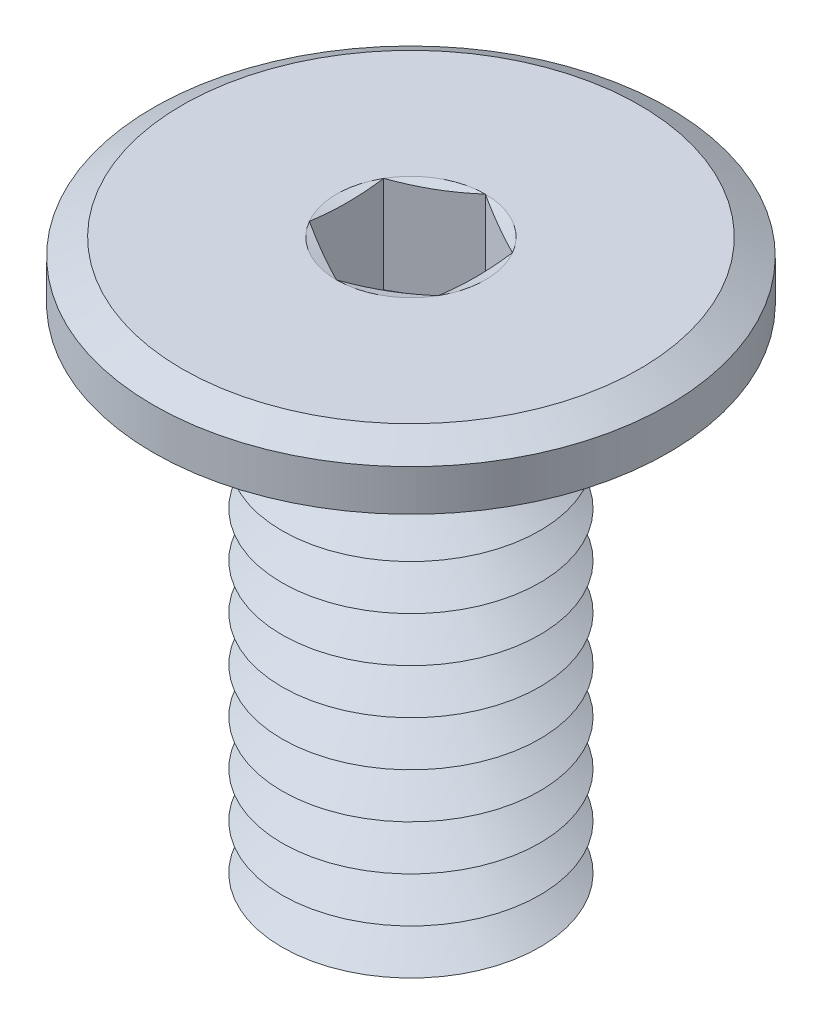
ISO-10303-21;
HEADER;
FILE_DESCRIPTION(('STEP AP214'),'2;1');
FILE_NAME('part.step','',(''),(''),'','','');
FILE_SCHEMA(('AUTOMOTIVE_DESIGN { 1 0 10303 214 1 1 1 1 }'));
ENDSEC;
DATA;
#1=APPLICATION_CONTEXT('core data for automotive mechanical design processes');
#2=APPLICATION_PROTOCOL_DEFINITION('international standard','automotive_design',2000,#1);
#3=PRODUCT_CONTEXT('',#1,'mechanical');
#4=PRODUCT('Part','Part','',(#3));
#5=PRODUCT_RELATED_PRODUCT_CATEGORY('part','',(#4));
#6=PRODUCT_DEFINITION_FORMATION('','',#4);
#7=PRODUCT_DEFINITION_CONTEXT('part definition',#1,'design');
#8=PRODUCT_DEFINITION('design','',#6,#7);
#9=PRODUCT_DEFINITION_SHAPE('','',#8);
#10=(LENGTH_UNIT() NAMED_UNIT(*) SI_UNIT(.MILLI.,.METRE.));
#11=(NAMED_UNIT(*) PLANE_ANGLE_UNIT() SI_UNIT($,.RADIAN.));
#12=(NAMED_UNIT(*) SI_UNIT($,.STERADIAN.) SOLID_ANGLE_UNIT());
#13=UNCERTAINTY_MEASURE_WITH_UNIT(LENGTH_MEASURE(1.E-05),#10,'distance_accuracy_value','');
#14=(GEOMETRIC_REPRESENTATION_CONTEXT(3) GLOBAL_UNCERTAINTY_ASSIGNED_CONTEXT((#13)) GLOBAL_UNIT_ASSIGNED_CONTEXT((#10,
#11,#12)) REPRESENTATION_CONTEXT('',''));
#15=CARTESIAN_POINT('',(0.,0.,0.));
#16=DIRECTION('',(0.,0.,1.));
#17=DIRECTION('',(1.,0.,0.));
#18=AXIS2_PLACEMENT_3D('',#15,#16,#17);
#19=CARTESIAN_POINT('',(0.,-7.85,0.));
#20=DIRECTION('',(0.,-1.,0.));
#21=DIRECTION('',(0.,0.,-1.));
#22=AXIS2_PLACEMENT_3D('',#19,#20,#21);
#23=CONICAL_SURFACE('',#22,2.,1.0471975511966);
#24=CARTESIAN_POINT('',(0.,-7.5,0.));
#25=DIRECTION('',(0.,1.,0.));
#26=DIRECTION('',(0.,0.,1.));
#27=AXIS2_PLACEMENT_3D('',#24,#25,#26);
#28=CIRCLE('',#27,1.39378221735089);
#29=CARTESIAN_POINT('',(0.,-7.5,1.39378221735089));
#30=VERTEX_POINT('',#29);
#31=EDGE_CURVE('E433',#30,#30,#28,.T.);
#32=ORIENTED_EDGE('',*,*,#31,.F.);
#33=EDGE_LOOP('',(#32));
#34=FACE_BOUND('',#33,.T.);
#35=CARTESIAN_POINT('',(0.,-7.85,0.));
#36=DIRECTION('',(0.,1.,0.));
#37=DIRECTION('',(0.,0.,1.));
#38=AXIS2_PLACEMENT_3D('',#35,#36,#37);
#39=CIRCLE('',#38,2.);
#40=CARTESIAN_POINT('',(0.,-7.85,2.));
#41=VERTEX_POINT('',#40);
#42=EDGE_CURVE('E437',#41,#41,#39,.T.);
#43=ORIENTED_EDGE('',*,*,#42,.T.);
#44=EDGE_LOOP('',(#43));
#45=FACE_BOUND('',#44,.T.);
#46=ADVANCED_FACE('F39',(#34,#45),#23,.T.);
#47=CARTESIAN_POINT('',(0.,-7.5,0.));
#48=DIRECTION('',(0.,1.,0.));
#49=DIRECTION('',(0.,0.,1.));
#50=AXIS2_PLACEMENT_3D('',#47,#48,#49);
#51=CONICAL_SURFACE('',#50,1.39378221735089,1.0471975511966);
#52=CARTESIAN_POINT('',(0.,-7.15,0.));
#53=DIRECTION('',(0.,1.,0.));
#54=DIRECTION('',(0.,0.,1.));
#55=AXIS2_PLACEMENT_3D('',#52,#53,#54);
#56=CIRCLE('',#55,2.);
#57=CARTESIAN_POINT('',(0.,-7.15,2.));
#58=VERTEX_POINT('',#57);
#59=EDGE_CURVE('E430',#58,#58,#56,.T.);
#60=ORIENTED_EDGE('',*,*,#59,.F.);
#61=EDGE_LOOP('',(#60));
#62=FACE_BOUND('',#61,.T.);
#63=ORIENTED_EDGE('',*,*,#31,.T.);
#64=EDGE_LOOP('',(#63));
#65=FACE_BOUND('',#64,.T.);
#66=ADVANCED_FACE('F233',(#62,#65),#51,.T.);
#67=CARTESIAN_POINT('',(0.,-8.9,0.));
#68=DIRECTION('',(0.,-1.,0.));
#69=DIRECTION('',(0.,0.,-1.));
#70=AXIS2_PLACEMENT_3D('',#67,#68,#69);
#71=PLANE('',#70);
#72=CARTESIAN_POINT('',(0.,-8.9,0.));
#73=DIRECTION('',(0.,1.,0.));
#74=DIRECTION('',(0.,0.,1.));
#75=AXIS2_PLACEMENT_3D('',#72,#73,#74);
#76=CIRCLE('',#75,1.39378221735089);
#77=CARTESIAN_POINT('',(0.,-8.9,1.39378221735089));
#78=VERTEX_POINT('',#77);
#79=EDGE_CURVE('E299',#78,#78,#76,.T.);
#80=ORIENTED_EDGE('',*,*,#79,.F.);
#81=EDGE_LOOP('',(#80));
#82=FACE_BOUND('',#81,.T.);
#83=ADVANCED_FACE('F239',(#82),#71,.T.);
#84=CARTESIAN_POINT('',(0.,-8.9,0.));
#85=DIRECTION('',(0.,1.,0.));
#86=DIRECTION('',(0.,0.,1.));
#87=AXIS2_PLACEMENT_3D('',#84,#85,#86);
#88=CONICAL_SURFACE('',#87,1.39378221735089,1.0471975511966);
#89=CARTESIAN_POINT('',(0.,-8.55,0.));
#90=DIRECTION('',(0.,1.,0.));
#91=DIRECTION('',(0.,0.,1.));
#92=AXIS2_PLACEMENT_3D('',#89,#90,#91);
#93=CIRCLE('',#92,2.);
#94=CARTESIAN_POINT('',(0.,-8.55,2.));
#95=VERTEX_POINT('',#94);
#96=EDGE_CURVE('E444',#95,#95,#93,.T.);
#97=ORIENTED_EDGE('',*,*,#96,.F.);
#98=EDGE_LOOP('',(#97));
#99=FACE_BOUND('',#98,.T.);
#100=ORIENTED_EDGE('',*,*,#79,.T.);
#101=EDGE_LOOP('',(#100));
#102=FACE_BOUND('',#101,.T.);
#103=ADVANCED_FACE('F254',(#99,#102),#88,.T.);
#104=CARTESIAN_POINT('',(0.,-8.55,0.));
#105=DIRECTION('',(0.,-1.,0.));
#106=DIRECTION('',(0.,0.,-1.));
#107=AXIS2_PLACEMENT_3D('',#104,#105,#106);
#108=CONICAL_SURFACE('',#107,2.,1.0471975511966);
#109=CARTESIAN_POINT('',(0.,-8.2,0.));
#110=DIRECTION('',(0.,1.,0.));
#111=DIRECTION('',(0.,0.,1.));
#112=AXIS2_PLACEMENT_3D('',#109,#110,#111);
#113=CIRCLE('',#112,1.39378221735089);
#114=CARTESIAN_POINT('',(0.,-8.2,1.39378221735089));
#115=VERTEX_POINT('',#114);
#116=EDGE_CURVE('E440',#115,#115,#113,.T.);
#117=ORIENTED_EDGE('',*,*,#116,.F.);
#118=EDGE_LOOP('',(#117));
#119=FACE_BOUND('',#118,.T.);
#120=ORIENTED_EDGE('',*,*,#96,.T.);
#121=EDGE_LOOP('',(#120));
#122=FACE_BOUND('',#121,.T.);
#123=ADVANCED_FACE('F250',(#119,#122),#108,.T.);
#124=CARTESIAN_POINT('',(0.,-8.2,0.));
#125=DIRECTION('',(0.,1.,0.));
#126=DIRECTION('',(0.,0.,1.));
#127=AXIS2_PLACEMENT_3D('',#124,#125,#126);
#128=CONICAL_SURFACE('',#127,1.39378221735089,1.0471975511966);
#129=ORIENTED_EDGE('',*,*,#42,.F.);
#130=EDGE_LOOP('',(#129));
#131=FACE_BOUND('',#130,.T.);
#132=ORIENTED_EDGE('',*,*,#116,.T.);
#133=EDGE_LOOP('',(#132));
#134=FACE_BOUND('',#133,.T.);
#135=ADVANCED_FACE('F246',(#131,#134),#128,.T.);
#136=CARTESIAN_POINT('',(0.,-7.15,0.));
#137=DIRECTION('',(0.,-1.,0.));
#138=DIRECTION('',(0.,0.,-1.));
#139=AXIS2_PLACEMENT_3D('',#136,#137,#138);
#140=CONICAL_SURFACE('',#139,2.,1.0471975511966);
#141=CARTESIAN_POINT('',(0.,-6.8,0.));
#142=DIRECTION('',(0.,1.,0.));
#143=DIRECTION('',(0.,0.,1.));
#144=AXIS2_PLACEMENT_3D('',#141,#142,#143);
#145=CIRCLE('',#144,1.39378221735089);
#146=CARTESIAN_POINT('',(0.,-6.8,1.39378221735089));
#147=VERTEX_POINT('',#146);
#148=EDGE_CURVE('E426',#147,#147,#145,.T.);
#149=ORIENTED_EDGE('',*,*,#148,.F.);
#150=EDGE_LOOP('',(#149));
#151=FACE_BOUND('',#150,.T.);
#152=ORIENTED_EDGE('',*,*,#59,.T.);
#153=EDGE_LOOP('',(#152));
#154=FACE_BOUND('',#153,.T.);
#155=ADVANCED_FACE('F249',(#151,#154),#140,.T.);
#156=CARTESIAN_POINT('',(0.,-6.8,0.));
#157=DIRECTION('',(0.,1.,0.));
#158=DIRECTION('',(0.,0.,1.));
#159=AXIS2_PLACEMENT_3D('',#156,#157,#158);
#160=CONICAL_SURFACE('',#159,1.39378221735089,1.0471975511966);
#161=CARTESIAN_POINT('',(0.,-6.45,0.));
#162=DIRECTION('',(0.,1.,0.));
#163=DIRECTION('',(0.,0.,1.));
#164=AXIS2_PLACEMENT_3D('',#161,#162,#163);
#165=CIRCLE('',#164,2.);
#166=CARTESIAN_POINT('',(0.,-6.45,2.));
#167=VERTEX_POINT('',#166);
#168=EDGE_CURVE('E422',#167,#167,#165,.T.);
#169=ORIENTED_EDGE('',*,*,#168,.F.);
#170=EDGE_LOOP('',(#169));
#171=FACE_BOUND('',#170,.T.);
#172=ORIENTED_EDGE('',*,*,#148,.T.);
#173=EDGE_LOOP('',(#172));
#174=FACE_BOUND('',#173,.T.);
#175=ADVANCED_FACE('F554',(#171,#174),#160,.T.);
#176=CARTESIAN_POINT('',(0.,-6.45,0.));
#177=DIRECTION('',(0.,-1.,0.));
#178=DIRECTION('',(0.,0.,-1.));
#179=AXIS2_PLACEMENT_3D('',#176,#177,#178);
#180=CONICAL_SURFACE('',#179,2.,1.0471975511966);
#181=CARTESIAN_POINT('',(0.,-6.1,0.));
#182=DIRECTION('',(0.,1.,0.));
#183=DIRECTION('',(0.,0.,1.));
#184=AXIS2_PLACEMENT_3D('',#181,#182,#183);
#185=CIRCLE('',#184,1.39378221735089);
#186=CARTESIAN_POINT('',(0.,-6.1,1.39378221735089));
#187=VERTEX_POINT('',#186);
#188=EDGE_CURVE('E418',#187,#187,#185,.T.);
#189=ORIENTED_EDGE('',*,*,#188,.F.);
#190=EDGE_LOOP('',(#189));
#191=FACE_BOUND('',#190,.T.);
#192=ORIENTED_EDGE('',*,*,#168,.T.);
#193=EDGE_LOOP('',(#192));
#194=FACE_BOUND('',#193,.T.);
#195=ADVANCED_FACE('F550',(#191,#194),#180,.T.);
#196=CARTESIAN_POINT('',(0.,-6.1,0.));
#197=DIRECTION('',(0.,1.,0.));
#198=DIRECTION('',(0.,0.,1.));
#199=AXIS2_PLACEMENT_3D('',#196,#197,#198);
#200=CONICAL_SURFACE('',#199,1.39378221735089,1.0471975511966);
#201=CARTESIAN_POINT('',(0.,-5.75,0.));
#202=DIRECTION('',(0.,1.,0.));
#203=DIRECTION('',(0.,0.,1.));
#204=AXIS2_PLACEMENT_3D('',#201,#202,#203);
#205=CIRCLE('',#204,2.);
#206=CARTESIAN_POINT('',(0.,-5.75,2.));
#207=VERTEX_POINT('',#206);
#208=EDGE_CURVE('E414',#207,#207,#205,.T.);
#209=ORIENTED_EDGE('',*,*,#208,.F.);
#210=EDGE_LOOP('',(#209));
#211=FACE_BOUND('',#210,.T.);
#212=ORIENTED_EDGE('',*,*,#188,.T.);
#213=EDGE_LOOP('',(#212));
#214=FACE_BOUND('',#213,.T.);
#215=ADVANCED_FACE('F546',(#211,#214),#200,.T.);
#216=CARTESIAN_POINT('',(0.,-5.75,0.));
#217=DIRECTION('',(0.,-1.,0.));
#218=DIRECTION('',(0.,0.,-1.));
#219=AXIS2_PLACEMENT_3D('',#216,#217,#218);
#220=CONICAL_SURFACE('',#219,2.,1.0471975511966);
#221=CARTESIAN_POINT('',(0.,-5.4,0.));
#222=DIRECTION('',(0.,1.,0.));
#223=DIRECTION('',(0.,0.,1.));
#224=AXIS2_PLACEMENT_3D('',#221,#222,#223);
#225=CIRCLE('',#224,1.39378221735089);
#226=CARTESIAN_POINT('',(0.,-5.4,1.39378221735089));
#227=VERTEX_POINT('',#226);
#228=EDGE_CURVE('E410',#227,#227,#225,.T.);
#229=ORIENTED_EDGE('',*,*,#228,.F.);
#230=EDGE_LOOP('',(#229));
#231=FACE_BOUND('',#230,.T.);
#232=ORIENTED_EDGE('',*,*,#208,.T.);
#233=EDGE_LOOP('',(#232));
#234=FACE_BOUND('',#233,.T.);
#235=ADVANCED_FACE('F542',(#231,#234),#220,.T.);
#236=CARTESIAN_POINT('',(0.,-5.4,0.));
#237=DIRECTION('',(0.,1.,0.));
#238=DIRECTION('',(0.,0.,1.));
#239=AXIS2_PLACEMENT_3D('',#236,#237,#238);
#240=CONICAL_SURFACE('',#239,1.39378221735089,1.0471975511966);
#241=CARTESIAN_POINT('',(0.,-5.05,0.));
#242=DIRECTION('',(0.,1.,0.));
#243=DIRECTION('',(0.,0.,1.));
#244=AXIS2_PLACEMENT_3D('',#241,#242,#243);
#245=CIRCLE('',#244,2.);
#246=CARTESIAN_POINT('',(0.,-5.05,2.));
#247=VERTEX_POINT('',#246);
#248=EDGE_CURVE('E407',#247,#247,#245,.T.);
#249=ORIENTED_EDGE('',*,*,#248,.F.);
#250=EDGE_LOOP('',(#249));
#251=FACE_BOUND('',#250,.T.);
#252=ORIENTED_EDGE('',*,*,#228,.T.);
#253=EDGE_LOOP('',(#252));
#254=FACE_BOUND('',#253,.T.);
#255=ADVANCED_FACE('F538',(#251,#254),#240,.T.);
#256=CARTESIAN_POINT('',(0.,-5.05,0.));
#257=DIRECTION('',(0.,-1.,0.));
#258=DIRECTION('',(0.,0.,-1.));
#259=AXIS2_PLACEMENT_3D('',#256,#257,#258);
#260=CONICAL_SURFACE('',#259,2.,1.0471975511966);
#261=CARTESIAN_POINT('',(0.,-4.7,0.));
#262=DIRECTION('',(0.,1.,0.));
#263=DIRECTION('',(0.,0.,1.));
#264=AXIS2_PLACEMENT_3D('',#261,#262,#263);
#265=CIRCLE('',#264,1.39378221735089);
#266=CARTESIAN_POINT('',(0.,-4.7,1.39378221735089));
#267=VERTEX_POINT('',#266);
#268=EDGE_CURVE('E403',#267,#267,#265,.T.);
#269=ORIENTED_EDGE('',*,*,#268,.F.);
#270=EDGE_LOOP('',(#269));
#271=FACE_BOUND('',#270,.T.);
#272=ORIENTED_EDGE('',*,*,#248,.T.);
#273=EDGE_LOOP('',(#272));
#274=FACE_BOUND('',#273,.T.);
#275=ADVANCED_FACE('F534',(#271,#274),#260,.T.);
#276=CARTESIAN_POINT('',(0.,-4.7,0.));
#277=DIRECTION('',(0.,1.,0.));
#278=DIRECTION('',(0.,0.,1.));
#279=AXIS2_PLACEMENT_3D('',#276,#277,#278);
#280=CONICAL_SURFACE('',#279,1.39378221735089,1.0471975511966);
#281=CARTESIAN_POINT('',(0.,-4.35,0.));
#282=DIRECTION('',(0.,1.,0.));
#283=DIRECTION('',(0.,0.,1.));
#284=AXIS2_PLACEMENT_3D('',#281,#282,#283);
#285=CIRCLE('',#284,2.);
#286=CARTESIAN_POINT('',(0.,-4.35,2.));
#287=VERTEX_POINT('',#286);
#288=EDGE_CURVE('E399',#287,#287,#285,.T.);
#289=ORIENTED_EDGE('',*,*,#288,.F.);
#290=EDGE_LOOP('',(#289));
#291=FACE_BOUND('',#290,.T.);
#292=ORIENTED_EDGE('',*,*,#268,.T.);
#293=EDGE_LOOP('',(#292));
#294=FACE_BOUND('',#293,.T.);
#295=ADVANCED_FACE('F530',(#291,#294),#280,.T.);
#296=CARTESIAN_POINT('',(0.,-4.35,0.));
#297=DIRECTION('',(0.,-1.,0.));
#298=DIRECTION('',(0.,0.,-1.));
#299=AXIS2_PLACEMENT_3D('',#296,#297,#298);
#300=CONICAL_SURFACE('',#299,2.,1.0471975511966);
#301=CARTESIAN_POINT('',(0.,-4.,0.));
#302=DIRECTION('',(0.,1.,0.));
#303=DIRECTION('',(0.,0.,1.));
#304=AXIS2_PLACEMENT_3D('',#301,#302,#303);
#305=CIRCLE('',#304,1.39378221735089);
#306=CARTESIAN_POINT('',(0.,-4.,1.39378221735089));
#307=VERTEX_POINT('',#306);
#308=EDGE_CURVE('E396',#307,#307,#305,.T.);
#309=ORIENTED_EDGE('',*,*,#308,.F.);
#310=EDGE_LOOP('',(#309));
#311=FACE_BOUND('',#310,.T.);
#312=ORIENTED_EDGE('',*,*,#288,.T.);
#313=EDGE_LOOP('',(#312));
#314=FACE_BOUND('',#313,.T.);
#315=ADVANCED_FACE('F526',(#311,#314),#300,.T.);
#316=CARTESIAN_POINT('',(0.,-4.,0.));
#317=DIRECTION('',(0.,1.,0.));
#318=DIRECTION('',(0.,0.,1.));
#319=AXIS2_PLACEMENT_3D('',#316,#317,#318);
#320=CONICAL_SURFACE('',#319,1.39378221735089,1.0471975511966);
#321=CARTESIAN_POINT('',(0.,-3.65,0.));
#322=DIRECTION('',(0.,1.,0.));
#323=DIRECTION('',(0.,0.,1.));
#324=AXIS2_PLACEMENT_3D('',#321,#322,#323);
#325=CIRCLE('',#324,2.);
#326=CARTESIAN_POINT('',(0.,-3.65,2.));
#327=VERTEX_POINT('',#326);
#328=EDGE_CURVE('E392',#327,#327,#325,.T.);
#329=ORIENTED_EDGE('',*,*,#328,.F.);
#330=EDGE_LOOP('',(#329));
#331=FACE_BOUND('',#330,.T.);
#332=ORIENTED_EDGE('',*,*,#308,.T.);
#333=EDGE_LOOP('',(#332));
#334=FACE_BOUND('',#333,.T.);
#335=ADVANCED_FACE('F522',(#331,#334),#320,.T.);
#336=CARTESIAN_POINT('',(0.,-3.65,0.));
#337=DIRECTION('',(0.,-1.,0.));
#338=DIRECTION('',(0.,0.,-1.));
#339=AXIS2_PLACEMENT_3D('',#336,#337,#338);
#340=CONICAL_SURFACE('',#339,2.,1.0471975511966);
#341=CARTESIAN_POINT('',(0.,-3.3,0.));
#342=DIRECTION('',(0.,1.,0.));
#343=DIRECTION('',(0.,0.,1.));
#344=AXIS2_PLACEMENT_3D('',#341,#342,#343);
#345=CIRCLE('',#344,1.39378221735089);
#346=CARTESIAN_POINT('',(0.,-3.3,1.39378221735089));
#347=VERTEX_POINT('',#346);
#348=EDGE_CURVE('E388',#347,#347,#345,.T.);
#349=ORIENTED_EDGE('',*,*,#348,.F.);
#350=EDGE_LOOP('',(#349));
#351=FACE_BOUND('',#350,.T.);
#352=ORIENTED_EDGE('',*,*,#328,.T.);
#353=EDGE_LOOP('',(#352));
#354=FACE_BOUND('',#353,.T.);
#355=ADVANCED_FACE('F518',(#351,#354),#340,.T.);
#356=CARTESIAN_POINT('',(0.,-3.3,0.));
#357=DIRECTION('',(0.,1.,0.));
#358=DIRECTION('',(0.,0.,1.));
#359=AXIS2_PLACEMENT_3D('',#356,#357,#358);
#360=CONICAL_SURFACE('',#359,1.39378221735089,1.0471975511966);
#361=CARTESIAN_POINT('',(0.,-2.95,0.));
#362=DIRECTION('',(0.,1.,0.));
#363=DIRECTION('',(0.,0.,1.));
#364=AXIS2_PLACEMENT_3D('',#361,#362,#363);
#365=CIRCLE('',#364,2.);
#366=CARTESIAN_POINT('',(0.,-2.95,2.));
#367=VERTEX_POINT('',#366);
#368=EDGE_CURVE('E384',#367,#367,#365,.T.);
#369=ORIENTED_EDGE('',*,*,#368,.F.);
#370=EDGE_LOOP('',(#369));
#371=FACE_BOUND('',#370,.T.);
#372=ORIENTED_EDGE('',*,*,#348,.T.);
#373=EDGE_LOOP('',(#372));
#374=FACE_BOUND('',#373,.T.);
#375=ADVANCED_FACE('F514',(#371,#374),#360,.T.);
#376=CARTESIAN_POINT('',(0.,-2.95,0.));
#377=DIRECTION('',(0.,-1.,0.));
#378=DIRECTION('',(0.,0.,-1.));
#379=AXIS2_PLACEMENT_3D('',#376,#377,#378);
#380=CONICAL_SURFACE('',#379,2.,1.0471975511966);
#381=CARTESIAN_POINT('',(0.,-2.6,0.));
#382=DIRECTION('',(0.,1.,0.));
#383=DIRECTION('',(0.,0.,1.));
#384=AXIS2_PLACEMENT_3D('',#381,#382,#383);
#385=CIRCLE('',#384,1.39378221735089);
#386=CARTESIAN_POINT('',(0.,-2.6,1.39378221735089));
#387=VERTEX_POINT('',#386);
#388=EDGE_CURVE('E381',#387,#387,#385,.T.);
#389=ORIENTED_EDGE('',*,*,#388,.F.);
#390=EDGE_LOOP('',(#389));
#391=FACE_BOUND('',#390,.T.);
#392=ORIENTED_EDGE('',*,*,#368,.T.);
#393=EDGE_LOOP('',(#392));
#394=FACE_BOUND('',#393,.T.);
#395=ADVANCED_FACE('F510',(#391,#394),#380,.T.);
#396=CARTESIAN_POINT('',(0.,-2.6,0.));
#397=DIRECTION('',(0.,1.,0.));
#398=DIRECTION('',(0.,0.,1.));
#399=AXIS2_PLACEMENT_3D('',#396,#397,#398);
#400=CONICAL_SURFACE('',#399,1.39378221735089,1.0471975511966);
#401=CARTESIAN_POINT('',(0.,-2.25,0.));
#402=DIRECTION('',(0.,1.,0.));
#403=DIRECTION('',(0.,0.,1.));
#404=AXIS2_PLACEMENT_3D('',#401,#402,#403);
#405=CIRCLE('',#404,2.);
#406=CARTESIAN_POINT('',(0.,-2.25,2.));
#407=VERTEX_POINT('',#406);
#408=EDGE_CURVE('E366',#407,#407,#405,.T.);
#409=ORIENTED_EDGE('',*,*,#408,.F.);
#410=EDGE_LOOP('',(#409));
#411=FACE_BOUND('',#410,.T.);
#412=ORIENTED_EDGE('',*,*,#388,.T.);
#413=EDGE_LOOP('',(#412));
#414=FACE_BOUND('',#413,.T.);
#415=ADVANCED_FACE('F274',(#411,#414),#400,.T.);
#416=CARTESIAN_POINT('',(0.,0.,0.));
#417=DIRECTION('',(0.,1.,0.));
#418=DIRECTION('',(0.,0.,1.));
#419=AXIS2_PLACEMENT_3D('',#416,#417,#418);
#420=PLANE('',#419);
#421=CARTESIAN_POINT('',(0.,0.,0.));
#422=DIRECTION('',(0.,1.,0.));
#423=DIRECTION('',(0.,0.,1.));
#424=AXIS2_PLACEMENT_3D('',#421,#422,#423);
#425=CIRCLE('',#424,1.15470053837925);
#426=CARTESIAN_POINT('',(0.,0.,1.15470053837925));
#427=VERTEX_POINT('',#426);
#428=CARTESIAN_POINT('',(1.,0.,0.577350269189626));
#429=VERTEX_POINT('',#428);
#430=EDGE_CURVE('E66',#427,#429,#425,.T.);
#431=ORIENTED_EDGE('',*,*,#430,.F.);
#432=CARTESIAN_POINT('',(-1.,0.,0.577350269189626));
#433=VERTEX_POINT('',#432);
#434=EDGE_CURVE('E169',#433,#427,#425,.T.);
#435=ORIENTED_EDGE('',*,*,#434,.F.);
#436=CARTESIAN_POINT('',(-1.,0.,-0.577350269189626));
#437=VERTEX_POINT('',#436);
#438=EDGE_CURVE('E164',#437,#433,#425,.T.);
#439=ORIENTED_EDGE('',*,*,#438,.F.);
#440=CARTESIAN_POINT('',(0.,0.,-1.15470053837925));
#441=VERTEX_POINT('',#440);
#442=EDGE_CURVE('E128',#441,#437,#425,.T.);
#443=ORIENTED_EDGE('',*,*,#442,.F.);
#444=CARTESIAN_POINT('',(1.,0.,-0.577350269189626));
#445=VERTEX_POINT('',#444);
#446=EDGE_CURVE('E119',#445,#441,#425,.T.);
#447=ORIENTED_EDGE('',*,*,#446,.F.);
#448=EDGE_CURVE('E59',#429,#445,#425,.T.);
#449=ORIENTED_EDGE('',*,*,#448,.F.);
#450=EDGE_LOOP('',(#431,#435,#439,#443,#447,#449));
#451=FACE_BOUND('',#450,.T.);
#452=CARTESIAN_POINT('',(0.,0.,0.));
#453=DIRECTION('',(0.,1.,0.));
#454=DIRECTION('',(0.,0.,1.));
#455=AXIS2_PLACEMENT_3D('',#452,#453,#454);
#456=CIRCLE('',#455,3.55);
#457=CARTESIAN_POINT('',(0.,0.,3.55));
#458=VERTEX_POINT('',#457);
#459=EDGE_CURVE('E296',#458,#458,#456,.T.);
#460=ORIENTED_EDGE('',*,*,#459,.T.);
#461=EDGE_LOOP('',(#460));
#462=FACE_BOUND('',#461,.T.);
#463=ADVANCED_FACE('F160',(#451,#462),#420,.T.);
#464=CARTESIAN_POINT('',(0.,-0.9,0.));
#465=DIRECTION('',(0.,1.,0.));
#466=DIRECTION('',(0.,0.,1.));
#467=AXIS2_PLACEMENT_3D('',#464,#465,#466);
#468=CYLINDRICAL_SURFACE('',#467,4.);
#469=CARTESIAN_POINT('',(0.,-0.259807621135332,0.));
#470=DIRECTION('',(0.,1.,0.));
#471=DIRECTION('',(0.,0.,1.));
#472=AXIS2_PLACEMENT_3D('',#469,#470,#471);
#473=CIRCLE('',#472,4.);
#474=CARTESIAN_POINT('',(0.,-0.259807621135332,4.));
#475=VERTEX_POINT('',#474);
#476=EDGE_CURVE('E306',#475,#475,#473,.F.);
#477=ORIENTED_EDGE('',*,*,#476,.T.);
#478=EDGE_LOOP('',(#477));
#479=FACE_BOUND('',#478,.T.);
#480=CARTESIAN_POINT('',(0.,-0.9,0.));
#481=DIRECTION('',(0.,1.,0.));
#482=DIRECTION('',(0.,0.,1.));
#483=AXIS2_PLACEMENT_3D('',#480,#481,#482);
#484=CIRCLE('',#483,4.);
#485=CARTESIAN_POINT('',(0.,-0.9,4.));
#486=VERTEX_POINT('',#485);
#487=EDGE_CURVE('E291',#486,#486,#484,.T.);
#488=ORIENTED_EDGE('',*,*,#487,.T.);
#489=EDGE_LOOP('',(#488));
#490=FACE_BOUND('',#489,.T.);
#491=ADVANCED_FACE('F270',(#479,#490),#468,.T.);
#492=CARTESIAN_POINT('',(0.,-0.9,0.));
#493=DIRECTION('',(0.,1.,0.));
#494=DIRECTION('',(0.,0.,1.));
#495=AXIS2_PLACEMENT_3D('',#492,#493,#494);
#496=PLANE('',#495);
#497=CARTESIAN_POINT('',(0.,-0.9,0.));
#498=DIRECTION('',(0.,1.,0.));
#499=DIRECTION('',(0.,0.,1.));
#500=AXIS2_PLACEMENT_3D('',#497,#498,#499);
#501=CIRCLE('',#500,2.2);
#502=CARTESIAN_POINT('',(0.,-0.9,2.2));
#503=VERTEX_POINT('',#502);
#504=EDGE_CURVE('E286',#503,#503,#501,.T.);
#505=ORIENTED_EDGE('',*,*,#504,.T.);
#506=EDGE_LOOP('',(#505));
#507=FACE_BOUND('',#506,.T.);
#508=ORIENTED_EDGE('',*,*,#487,.F.);
#509=EDGE_LOOP('',(#508));
#510=FACE_BOUND('',#509,.T.);
#511=ADVANCED_FACE('F266',(#507,#510),#496,.F.);
#512=CARTESIAN_POINT('',(0.,-8.9,0.));
#513=DIRECTION('',(0.,1.,0.));
#514=DIRECTION('',(0.,0.,1.));
#515=AXIS2_PLACEMENT_3D('',#512,#513,#514);
#516=CYLINDRICAL_SURFACE('',#515,2.);
#517=CARTESIAN_POINT('',(0.,-1.1,0.));
#518=DIRECTION('',(0.,1.,0.));
#519=DIRECTION('',(0.,0.,1.));
#520=AXIS2_PLACEMENT_3D('',#517,#518,#519);
#521=CIRCLE('',#520,2.);
#522=CARTESIAN_POINT('',(0.,-1.1,2.));
#523=VERTEX_POINT('',#522);
#524=EDGE_CURVE('E289',#523,#523,#521,.F.);
#525=ORIENTED_EDGE('',*,*,#524,.T.);
#526=EDGE_LOOP('',(#525));
#527=FACE_BOUND('',#526,.T.);
#528=ORIENTED_EDGE('',*,*,#408,.T.);
#529=EDGE_LOOP('',(#528));
#530=FACE_BOUND('',#529,.T.);
#531=ADVANCED_FACE('F262',(#527,#530),#516,.T.);
#532=CARTESIAN_POINT('',(0.,-1.1,0.));
#533=DIRECTION('',(0.,1.,0.));
#534=DIRECTION('',(0.,0.,1.));
#535=AXIS2_PLACEMENT_3D('',#532,#533,#534);
#536=TOROIDAL_SURFACE('',#535,2.2,0.2);
#537=ORIENTED_EDGE('',*,*,#504,.F.);
#538=EDGE_LOOP('',(#537));
#539=FACE_BOUND('',#538,.T.);
#540=ORIENTED_EDGE('',*,*,#524,.F.);
#541=EDGE_LOOP('',(#540));
#542=FACE_BOUND('',#541,.T.);
#543=ADVANCED_FACE('F265',(#539,#542),#536,.F.);
#544=CARTESIAN_POINT('',(0.,0.,0.));
#545=DIRECTION('',(0.,-1.,0.));
#546=DIRECTION('',(0.,0.,-1.));
#547=AXIS2_PLACEMENT_3D('',#544,#545,#546);
#548=CONICAL_SURFACE('',#547,3.55,1.0471975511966);
#549=ORIENTED_EDGE('',*,*,#476,.F.);
#550=EDGE_LOOP('',(#549));
#551=FACE_BOUND('',#550,.T.);
#552=ORIENTED_EDGE('',*,*,#459,.F.);
#553=EDGE_LOOP('',(#552));
#554=FACE_BOUND('',#553,.T.);
#555=ADVANCED_FACE('F41',(#551,#554),#548,.T.);
#556=CARTESIAN_POINT('',(0.,0.,0.));
#557=DIRECTION('',(0.,1.,0.));
#558=DIRECTION('',(0.,0.,1.));
#559=AXIS2_PLACEMENT_3D('',#556,#557,#558);
#560=CONICAL_SURFACE('',#559,1.15470053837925,1.30899693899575);
#561=ORIENTED_EDGE('',*,*,#442,.T.);
#562=CARTESIAN_POINT('',(0.000200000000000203,3.09447482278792E-05,-1.15481600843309));
#563=CARTESIAN_POINT('',(-0.0413440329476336,-0.00640029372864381,-1.13083054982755));
#564=CARTESIAN_POINT('',(-0.0829634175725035,-0.012238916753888,-1.10680158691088));
#565=CARTESIAN_POINT('',(-0.166349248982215,-0.0224969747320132,-1.05865875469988));
#566=CARTESIAN_POINT('',(-0.208115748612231,-0.0269158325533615,-1.03454485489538));
#567=CARTESIAN_POINT('',(-0.291542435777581,-0.0340762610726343,-0.986378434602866));
#568=CARTESIAN_POINT('',(-0.333202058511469,-0.0368263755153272,-0.962326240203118));
#569=CARTESIAN_POINT('',(-0.416574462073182,-0.0405140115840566,-0.914191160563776));
#570=CARTESIAN_POINT('',(-0.458287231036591,-0.0414518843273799,-0.890108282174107));
#571=CARTESIAN_POINT('',(-0.541712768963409,-0.0414518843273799,-0.84194252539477));
#572=CARTESIAN_POINT('',(-0.583425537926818,-0.0405140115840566,-0.817859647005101));
#573=CARTESIAN_POINT('',(-0.666797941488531,-0.0368263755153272,-0.76972456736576));
#574=CARTESIAN_POINT('',(-0.708457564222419,-0.0340762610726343,-0.745672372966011));
#575=CARTESIAN_POINT('',(-0.791884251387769,-0.0269158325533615,-0.697505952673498));
#576=CARTESIAN_POINT('',(-0.833650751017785,-0.0224969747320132,-0.673392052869));
#577=CARTESIAN_POINT('',(-0.917036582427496,-0.012238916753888,-0.625249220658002));
#578=CARTESIAN_POINT('',(-0.958655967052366,-0.00640029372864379,-0.601220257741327));
#579=CARTESIAN_POINT('',(-1.0002,3.09447482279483E-05,-0.577234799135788));
#580=B_SPLINE_CURVE_WITH_KNOTS('',3,(#562,#563,#564,#565,#566,#567,#568,#569,#570,#571,#572,
#573,#574,#575,#576,#577,#578,#579),.UNSPECIFIED.,.F.,.F.,(4,2,2,2,2,2,2,2,4),(0.,
0.145207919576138,0.290474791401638,0.434991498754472,0.579480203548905,0.723968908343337,
0.868485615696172,1.01375248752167,1.15896040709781),.UNSPECIFIED.);
#581=EDGE_CURVE('E11',#441,#437,#580,.T.);
#582=ORIENTED_EDGE('',*,*,#581,.F.);
#583=EDGE_LOOP('',(#561,#582));
#584=FACE_BOUND('',#583,.T.);
#585=ADVANCED_FACE('F132',(#584),#560,.F.);
#586=ORIENTED_EDGE('',*,*,#438,.T.);
#587=CARTESIAN_POINT('',(-1.,0.236023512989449,-1.77298423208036));
#588=CARTESIAN_POINT('',(-1.,0.216107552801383,-1.6875314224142));
#589=CARTESIAN_POINT('',(-1.,0.196471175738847,-1.60200905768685));
#590=CARTESIAN_POINT('',(-1.,0.158144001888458,-1.43073686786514));
#591=CARTESIAN_POINT('',(-1.,0.139453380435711,-1.34498700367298));
#592=CARTESIAN_POINT('',(-1.,0.1032364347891,-1.17236724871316));
#593=CARTESIAN_POINT('',(-1.,0.0857232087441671,-1.08549457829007));
#594=CARTESIAN_POINT('',(-1.,0.0527507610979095,-0.911344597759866));
#595=CARTESIAN_POINT('',(-1.,0.0372917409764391,-0.824067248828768));
#596=CARTESIAN_POINT('',(-1.,0.00985747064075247,-0.651412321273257));
#597=CARTESIAN_POINT('',(-1.,-0.00220187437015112,-0.566048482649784));
#598=CARTESIAN_POINT('',(-1.,-0.0220616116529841,-0.394830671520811));
#599=CARTESIAN_POINT('',(-1.,-0.0298633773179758,-0.308976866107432));
#600=CARTESIAN_POINT('',(-1.,-0.0398601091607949,-0.137316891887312));
#601=CARTESIAN_POINT('',(-1.,-0.0420806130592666,-0.0515123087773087));
#602=CARTESIAN_POINT('',(-1.,-0.0405086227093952,0.120045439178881));
#603=CARTESIAN_POINT('',(-1.,-0.0367157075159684,0.20579860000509));
#604=CARTESIAN_POINT('',(-1.,-0.0256781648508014,0.353235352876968));
#605=CARTESIAN_POINT('',(-1.,-0.0196775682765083,0.415019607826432));
#606=CARTESIAN_POINT('',(-1.,-0.00545724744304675,0.538326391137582));
#607=CARTESIAN_POINT('',(-1.,0.00276242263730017,0.599848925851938));
#608=CARTESIAN_POINT('',(-1.,0.0300253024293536,0.784439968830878));
#609=CARTESIAN_POINT('',(-1.,0.0516350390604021,0.907124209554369));
#610=CARTESIAN_POINT('',(-1.,0.0871575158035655,1.09186138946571));
#611=CARTESIAN_POINT('',(-1.,0.0996614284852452,1.15420316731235));
#612=CARTESIAN_POINT('',(-1.,0.125434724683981,1.27873123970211));
#613=CARTESIAN_POINT('',(-1.,0.138704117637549,1.34091753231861));
#614=CARTESIAN_POINT('',(-1.,0.165737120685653,1.4648085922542));
#615=CARTESIAN_POINT('',(-1.,0.179497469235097,1.5265140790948));
#616=CARTESIAN_POINT('',(-1.,0.207459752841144,1.64982040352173));
#617=CARTESIAN_POINT('',(-1.,0.221661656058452,1.71142124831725));
#618=CARTESIAN_POINT('',(-1.,0.236023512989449,1.77298423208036));
#619=B_SPLINE_CURVE_WITH_KNOTS('',3,(#587,#588,#589,#590,#591,#592,#593,#594,#595,#596,#597,
#598,#599,#600,#601,#602,#603,#604,#605,#606,#607,#608,#609,#610,#611,#612,#613,#614,#615,#616,
#617,#618),.UNSPECIFIED.,.F.,.F.,(4,2,2,2,2,2,2,2,2,2,2,2,2,2,2,4),(0.,0.263234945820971,
0.52651851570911,0.792363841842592,1.0582352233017,1.31679695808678,1.5752752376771,
1.83256864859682,2.08988007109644,2.27606085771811,2.462237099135,2.83581575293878,
3.02656672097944,3.21732004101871,3.40698211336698,3.59663054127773),.UNSPECIFIED.);
#620=EDGE_CURVE('E172',#437,#433,#619,.T.);
#621=ORIENTED_EDGE('',*,*,#620,.F.);
#622=EDGE_LOOP('',(#586,#621));
#623=FACE_BOUND('',#622,.T.);
#624=ADVANCED_FACE('F636',(#623),#560,.F.);
#625=ORIENTED_EDGE('',*,*,#434,.T.);
#626=CARTESIAN_POINT('',(-1.0002,3.09447482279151E-05,0.577234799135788));
#627=CARTESIAN_POINT('',(-0.958655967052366,-0.00640029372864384,0.601220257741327));
#628=CARTESIAN_POINT('',(-0.917036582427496,-0.012238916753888,0.625249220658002));
#629=CARTESIAN_POINT('',(-0.833650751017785,-0.0224969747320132,0.673392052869));
#630=CARTESIAN_POINT('',(-0.791884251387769,-0.0269158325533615,0.697505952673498));
#631=CARTESIAN_POINT('',(-0.708457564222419,-0.0340762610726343,0.745672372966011));
#632=CARTESIAN_POINT('',(-0.666797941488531,-0.0368263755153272,0.76972456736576));
#633=CARTESIAN_POINT('',(-0.583425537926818,-0.0405140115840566,0.817859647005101));
#634=CARTESIAN_POINT('',(-0.541712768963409,-0.0414518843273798,0.84194252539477));
#635=CARTESIAN_POINT('',(-0.458287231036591,-0.0414518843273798,0.890108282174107));
#636=CARTESIAN_POINT('',(-0.416574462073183,-0.0405140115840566,0.914191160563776));
#637=CARTESIAN_POINT('',(-0.333202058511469,-0.0368263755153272,0.962326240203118));
#638=CARTESIAN_POINT('',(-0.291542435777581,-0.0340762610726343,0.986378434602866));
#639=CARTESIAN_POINT('',(-0.208115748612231,-0.0269158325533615,1.03454485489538));
#640=CARTESIAN_POINT('',(-0.166349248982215,-0.0224969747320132,1.05865875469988));
#641=CARTESIAN_POINT('',(-0.082963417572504,-0.0122389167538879,1.10680158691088));
#642=CARTESIAN_POINT('',(-0.0413440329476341,-0.00640029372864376,1.13083054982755));
#643=CARTESIAN_POINT('',(0.000199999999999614,3.09447482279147E-05,1.15481600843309));
#644=B_SPLINE_CURVE_WITH_KNOTS('',3,(#626,#627,#628,#629,#630,#631,#632,#633,#634,#635,#636,
#637,#638,#639,#640,#641,#642,#643),.UNSPECIFIED.,.F.,.F.,(4,2,2,2,2,2,2,2,4),(0.,
0.145207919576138,0.290474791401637,0.434991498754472,0.579480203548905,0.723968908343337,
0.868485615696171,1.01375248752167,1.15896040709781),.UNSPECIFIED.);
#645=EDGE_CURVE('E180',#433,#427,#644,.T.);
#646=ORIENTED_EDGE('',*,*,#645,.F.);
#647=EDGE_LOOP('',(#625,#646));
#648=FACE_BOUND('',#647,.T.);
#649=ADVANCED_FACE('F474',(#648),#560,.F.);
#650=ORIENTED_EDGE('',*,*,#430,.T.);
#651=CARTESIAN_POINT('',(-0.000200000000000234,3.09447482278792E-05,1.15481600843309));
#652=CARTESIAN_POINT('',(0.0413440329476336,-0.00640029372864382,1.13083054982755));
#653=CARTESIAN_POINT('',(0.0829634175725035,-0.012238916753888,1.10680158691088));
#654=CARTESIAN_POINT('',(0.166349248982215,-0.0224969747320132,1.05865875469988));
#655=CARTESIAN_POINT('',(0.208115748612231,-0.0269158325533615,1.03454485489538));
#656=CARTESIAN_POINT('',(0.291542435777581,-0.0340762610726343,0.986378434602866));
#657=CARTESIAN_POINT('',(0.333202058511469,-0.0368263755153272,0.962326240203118));
#658=CARTESIAN_POINT('',(0.416574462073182,-0.0405140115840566,0.914191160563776));
#659=CARTESIAN_POINT('',(0.458287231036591,-0.0414518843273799,0.890108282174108));
#660=CARTESIAN_POINT('',(0.541712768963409,-0.0414518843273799,0.84194252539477));
#661=CARTESIAN_POINT('',(0.583425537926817,-0.0405140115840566,0.817859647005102));
#662=CARTESIAN_POINT('',(0.666797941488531,-0.0368263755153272,0.76972456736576));
#663=CARTESIAN_POINT('',(0.708457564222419,-0.0340762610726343,0.745672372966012));
#664=CARTESIAN_POINT('',(0.791884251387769,-0.0269158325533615,0.697505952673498));
#665=CARTESIAN_POINT('',(0.833650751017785,-0.0224969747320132,0.673392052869));
#666=CARTESIAN_POINT('',(0.917036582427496,-0.012238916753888,0.625249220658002));
#667=CARTESIAN_POINT('',(0.958655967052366,-0.00640029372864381,0.601220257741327));
#668=CARTESIAN_POINT('',(1.0002,3.09447482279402E-05,0.577234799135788));
#669=B_SPLINE_CURVE_WITH_KNOTS('',3,(#651,#652,#653,#654,#655,#656,#657,#658,#659,#660,#661,
#662,#663,#664,#665,#666,#667,#668),.UNSPECIFIED.,.F.,.F.,(4,2,2,2,2,2,2,2,4),(0.,
0.145207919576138,0.290474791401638,0.434991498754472,0.579480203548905,0.723968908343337,
0.868485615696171,1.01375248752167,1.15896040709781),.UNSPECIFIED.);
#670=EDGE_CURVE('E199',#427,#429,#669,.T.);
#671=ORIENTED_EDGE('',*,*,#670,.F.);
#672=EDGE_LOOP('',(#650,#671));
#673=FACE_BOUND('',#672,.T.);
#674=ADVANCED_FACE('F476',(#673),#560,.F.);
#675=ORIENTED_EDGE('',*,*,#448,.T.);
#676=CARTESIAN_POINT('',(1.,0.23602351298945,1.77298423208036));
#677=CARTESIAN_POINT('',(1.,0.216107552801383,1.6875314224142));
#678=CARTESIAN_POINT('',(1.,0.196471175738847,1.60200905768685));
#679=CARTESIAN_POINT('',(1.,0.158144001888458,1.43073686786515));
#680=CARTESIAN_POINT('',(1.,0.139453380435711,1.34498700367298));
#681=CARTESIAN_POINT('',(1.,0.1032364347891,1.17236724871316));
#682=CARTESIAN_POINT('',(1.,0.0857232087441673,1.08549457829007));
#683=CARTESIAN_POINT('',(1.,0.0527507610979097,0.911344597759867));
#684=CARTESIAN_POINT('',(1.,0.0372917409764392,0.824067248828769));
#685=CARTESIAN_POINT('',(1.,0.00985747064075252,0.651412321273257));
#686=CARTESIAN_POINT('',(1.,-0.00220187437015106,0.566048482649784));
#687=CARTESIAN_POINT('',(1.,-0.0220616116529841,0.394830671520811));
#688=CARTESIAN_POINT('',(1.,-0.0298633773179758,0.308976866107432));
#689=CARTESIAN_POINT('',(1.,-0.0398601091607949,0.137316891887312));
#690=CARTESIAN_POINT('',(1.,-0.0420806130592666,0.051512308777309));
#691=CARTESIAN_POINT('',(1.,-0.0405086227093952,-0.120045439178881));
#692=CARTESIAN_POINT('',(1.,-0.0367157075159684,-0.205798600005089));
#693=CARTESIAN_POINT('',(1.,-0.0256781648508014,-0.353235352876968));
#694=CARTESIAN_POINT('',(1.,-0.0196775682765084,-0.415019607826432));
#695=CARTESIAN_POINT('',(1.,-0.00545724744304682,-0.538326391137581));
#696=CARTESIAN_POINT('',(1.,0.00276242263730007,-0.599848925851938));
#697=CARTESIAN_POINT('',(1.,0.0300253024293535,-0.784439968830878));
#698=CARTESIAN_POINT('',(1.,0.051635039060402,-0.907124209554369));
#699=CARTESIAN_POINT('',(1.,0.0871575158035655,-1.09186138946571));
#700=CARTESIAN_POINT('',(1.,0.0996614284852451,-1.15420316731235));
#701=CARTESIAN_POINT('',(1.,0.125434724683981,-1.27873123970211));
#702=CARTESIAN_POINT('',(1.,0.138704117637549,-1.34091753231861));
#703=CARTESIAN_POINT('',(1.,0.165737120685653,-1.4648085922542));
#704=CARTESIAN_POINT('',(1.,0.179497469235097,-1.5265140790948));
#705=CARTESIAN_POINT('',(1.,0.207459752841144,-1.64982040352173));
#706=CARTESIAN_POINT('',(1.,0.221661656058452,-1.71142124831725));
#707=CARTESIAN_POINT('',(1.,0.236023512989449,-1.77298423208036));
#708=B_SPLINE_CURVE_WITH_KNOTS('',3,(#676,#677,#678,#679,#680,#681,#682,#683,#684,#685,#686,
#687,#688,#689,#690,#691,#692,#693,#694,#695,#696,#697,#698,#699,#700,#701,#702,#703,#704,#705,
#706,#707),.UNSPECIFIED.,.F.,.F.,(4,2,2,2,2,2,2,2,2,2,2,2,2,2,2,4),(0.,0.263234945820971,
0.52651851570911,0.792363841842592,1.0582352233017,1.31679695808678,1.5752752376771,
1.83256864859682,2.08988007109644,2.27606085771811,2.462237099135,2.83581575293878,
3.02656672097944,3.21732004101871,3.40698211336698,3.59663054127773),.UNSPECIFIED.);
#709=EDGE_CURVE('E149',#429,#445,#708,.T.);
#710=ORIENTED_EDGE('',*,*,#709,.F.);
#711=EDGE_LOOP('',(#675,#710));
#712=FACE_BOUND('',#711,.T.);
#713=ADVANCED_FACE('F192',(#712),#560,.F.);
#714=ORIENTED_EDGE('',*,*,#446,.T.);
#715=CARTESIAN_POINT('',(1.0002,3.09447482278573E-05,-0.577234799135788));
#716=CARTESIAN_POINT('',(0.958655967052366,-0.00640029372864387,-0.601220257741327));
#717=CARTESIAN_POINT('',(0.917036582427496,-0.012238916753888,-0.625249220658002));
#718=CARTESIAN_POINT('',(0.833650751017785,-0.0224969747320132,-0.673392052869));
#719=CARTESIAN_POINT('',(0.791884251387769,-0.0269158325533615,-0.697505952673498));
#720=CARTESIAN_POINT('',(0.708457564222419,-0.0340762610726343,-0.745672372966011));
#721=CARTESIAN_POINT('',(0.666797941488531,-0.0368263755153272,-0.76972456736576));
#722=CARTESIAN_POINT('',(0.583425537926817,-0.0405140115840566,-0.817859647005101));
#723=CARTESIAN_POINT('',(0.541712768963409,-0.0414518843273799,-0.84194252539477));
#724=CARTESIAN_POINT('',(0.458287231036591,-0.0414518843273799,-0.890108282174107));
#725=CARTESIAN_POINT('',(0.416574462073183,-0.0405140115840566,-0.914191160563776));
#726=CARTESIAN_POINT('',(0.333202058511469,-0.0368263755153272,-0.962326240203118));
#727=CARTESIAN_POINT('',(0.291542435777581,-0.0340762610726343,-0.986378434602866));
#728=CARTESIAN_POINT('',(0.208115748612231,-0.0269158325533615,-1.03454485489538));
#729=CARTESIAN_POINT('',(0.166349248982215,-0.0224969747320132,-1.05865875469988));
#730=CARTESIAN_POINT('',(0.0829634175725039,-0.012238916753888,-1.10680158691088));
#731=CARTESIAN_POINT('',(0.0413440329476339,-0.00640029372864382,-1.13083054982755));
#732=CARTESIAN_POINT('',(-0.000199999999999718,3.09447482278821E-05,-1.15481600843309));
#733=B_SPLINE_CURVE_WITH_KNOTS('',3,(#715,#716,#717,#718,#719,#720,#721,#722,#723,#724,#725,
#726,#727,#728,#729,#730,#731,#732),.UNSPECIFIED.,.F.,.F.,(4,2,2,2,2,2,2,2,4),(0.,
0.145207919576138,0.290474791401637,0.434991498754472,0.579480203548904,0.723968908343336,
0.868485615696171,1.01375248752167,1.15896040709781),.UNSPECIFIED.);
#734=EDGE_CURVE('E123',#445,#441,#733,.T.);
#735=ORIENTED_EDGE('',*,*,#734,.F.);
#736=EDGE_LOOP('',(#714,#735));
#737=FACE_BOUND('',#736,.T.);
#738=ADVANCED_FACE('F121',(#737),#560,.F.);
#739=CARTESIAN_POINT('',(0.,-1.5,0.));
#740=DIRECTION('',(0.,1.,0.));
#741=DIRECTION('',(0.,0.,1.));
#742=AXIS2_PLACEMENT_3D('',#739,#740,#741);
#743=CONICAL_SURFACE('',#742,1.,1.0471975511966);
#744=CARTESIAN_POINT('',(0.,-2.07735026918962,0.));
#745=VERTEX_POINT('',#744);
#746=VERTEX_LOOP('',#745);
#747=FACE_BOUND('',#746,.T.);
#748=CARTESIAN_POINT('',(0.,-1.5,0.));
#749=DIRECTION('',(0.,1.,0.));
#750=DIRECTION('',(0.,0.,1.));
#751=AXIS2_PLACEMENT_3D('',#748,#749,#750);
#752=CIRCLE('',#751,1.);
#753=CARTESIAN_POINT('',(0.5,-1.5,0.866025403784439));
#754=VERTEX_POINT('',#753);
#755=CARTESIAN_POINT('',(1.,-1.5,0.));
#756=VERTEX_POINT('',#755);
#757=EDGE_CURVE('E148',#754,#756,#752,.T.);
#758=ORIENTED_EDGE('',*,*,#757,.T.);
#759=CARTESIAN_POINT('',(0.,-1.5,0.));
#760=DIRECTION('',(0.,1.,0.));
#761=DIRECTION('',(0.,0.,1.));
#762=AXIS2_PLACEMENT_3D('',#759,#760,#761);
#763=CIRCLE('',#762,1.);
#764=CARTESIAN_POINT('',(0.5,-1.5,-0.866025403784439));
#765=VERTEX_POINT('',#764);
#766=EDGE_CURVE('E53',#756,#765,#763,.T.);
#767=ORIENTED_EDGE('',*,*,#766,.T.);
#768=CARTESIAN_POINT('',(-0.5,-1.5,-0.866025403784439));
#769=VERTEX_POINT('',#768);
#770=EDGE_CURVE('E319',#765,#769,#763,.T.);
#771=ORIENTED_EDGE('',*,*,#770,.T.);
#772=CARTESIAN_POINT('',(-1.,-1.5,0.));
#773=VERTEX_POINT('',#772);
#774=EDGE_CURVE('E317',#769,#773,#763,.T.);
#775=ORIENTED_EDGE('',*,*,#774,.T.);
#776=CARTESIAN_POINT('',(-0.5,-1.5,0.866025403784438));
#777=VERTEX_POINT('',#776);
#778=EDGE_CURVE('E311',#773,#777,#763,.T.);
#779=ORIENTED_EDGE('',*,*,#778,.T.);
#780=EDGE_CURVE('E309',#777,#754,#763,.T.);
#781=ORIENTED_EDGE('',*,*,#780,.T.);
#782=EDGE_LOOP('',(#758,#767,#771,#775,#779,#781));
#783=FACE_BOUND('',#782,.T.);
#784=ADVANCED_FACE('F191',(#747,#783),#743,.F.);
#785=CARTESIAN_POINT('',(0.,-1.5,0.));
#786=DIRECTION('',(0.,1.,0.));
#787=DIRECTION('',(0.,0.,1.));
#788=AXIS2_PLACEMENT_3D('',#785,#786,#787);
#789=PLANE('',#788);
#790=ORIENTED_EDGE('',*,*,#766,.F.);
#791=DIRECTION('',(0.,0.,-1.));
#792=VECTOR('',#791,1.);
#793=CARTESIAN_POINT('',(1.,-1.5,0.577350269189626));
#794=LINE('',#793,#792);
#795=CARTESIAN_POINT('',(1.,-1.5,-0.577350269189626));
#796=VERTEX_POINT('',#795);
#797=EDGE_CURVE('E361',#756,#796,#794,.T.);
#798=ORIENTED_EDGE('',*,*,#797,.T.);
#799=DIRECTION('',(-0.866025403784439,0.,-0.5));
#800=VECTOR('',#799,1.);
#801=CARTESIAN_POINT('',(1.,-1.5,-0.577350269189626));
#802=LINE('',#801,#800);
#803=EDGE_CURVE('E452',#796,#765,#802,.T.);
#804=ORIENTED_EDGE('',*,*,#803,.T.);
#805=EDGE_LOOP('',(#790,#798,#804));
#806=FACE_BOUND('',#805,.T.);
#807=ADVANCED_FACE('F464',(#806),#789,.T.);
#808=ORIENTED_EDGE('',*,*,#757,.F.);
#809=DIRECTION('',(0.866025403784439,0.,-0.5));
#810=VECTOR('',#809,1.);
#811=CARTESIAN_POINT('',(0.,-1.5,1.15470053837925));
#812=LINE('',#811,#810);
#813=CARTESIAN_POINT('',(1.,-1.5,0.577350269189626));
#814=VERTEX_POINT('',#813);
#815=EDGE_CURVE('E356',#754,#814,#812,.T.);
#816=ORIENTED_EDGE('',*,*,#815,.T.);
#817=EDGE_CURVE('E157',#814,#756,#794,.T.);
#818=ORIENTED_EDGE('',*,*,#817,.T.);
#819=EDGE_LOOP('',(#808,#816,#818));
#820=FACE_BOUND('',#819,.T.);
#821=ADVANCED_FACE('F467',(#820),#789,.T.);
#822=ORIENTED_EDGE('',*,*,#780,.F.);
#823=DIRECTION('',(0.866025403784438,0.,0.5));
#824=VECTOR('',#823,1.);
#825=CARTESIAN_POINT('',(-1.,-1.5,0.577350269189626));
#826=LINE('',#825,#824);
#827=CARTESIAN_POINT('',(0.,-1.5,1.15470053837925));
#828=VERTEX_POINT('',#827);
#829=EDGE_CURVE('E348',#777,#828,#826,.T.);
#830=ORIENTED_EDGE('',*,*,#829,.T.);
#831=EDGE_CURVE('E357',#828,#754,#812,.T.);
#832=ORIENTED_EDGE('',*,*,#831,.T.);
#833=EDGE_LOOP('',(#822,#830,#832));
#834=FACE_BOUND('',#833,.T.);
#835=ADVANCED_FACE('F220',(#834),#789,.T.);
#836=ORIENTED_EDGE('',*,*,#778,.F.);
#837=DIRECTION('',(0.,0.,1.));
#838=VECTOR('',#837,1.);
#839=CARTESIAN_POINT('',(-1.,-1.5,-0.577350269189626));
#840=LINE('',#839,#838);
#841=CARTESIAN_POINT('',(-1.,-1.5,0.577350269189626));
#842=VERTEX_POINT('',#841);
#843=EDGE_CURVE('E337',#773,#842,#840,.T.);
#844=ORIENTED_EDGE('',*,*,#843,.T.);
#845=EDGE_CURVE('E340',#842,#777,#826,.T.);
#846=ORIENTED_EDGE('',*,*,#845,.T.);
#847=EDGE_LOOP('',(#836,#844,#846));
#848=FACE_BOUND('',#847,.T.);
#849=ADVANCED_FACE('F336',(#848),#789,.T.);
#850=ORIENTED_EDGE('',*,*,#770,.F.);
#851=CARTESIAN_POINT('',(0.,-1.5,-1.15470053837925));
#852=VERTEX_POINT('',#851);
#853=EDGE_CURVE('E456',#765,#852,#802,.T.);
#854=ORIENTED_EDGE('',*,*,#853,.T.);
#855=DIRECTION('',(-0.866025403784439,0.,0.5));
#856=VECTOR('',#855,1.);
#857=CARTESIAN_POINT('',(0.,-1.5,-1.15470053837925));
#858=LINE('',#857,#856);
#859=EDGE_CURVE('E154',#852,#769,#858,.T.);
#860=ORIENTED_EDGE('',*,*,#859,.T.);
#861=EDGE_LOOP('',(#850,#854,#860));
#862=FACE_BOUND('',#861,.T.);
#863=ADVANCED_FACE('F486',(#862),#789,.T.);
#864=ORIENTED_EDGE('',*,*,#774,.F.);
#865=CARTESIAN_POINT('',(-1.,-1.5,-0.577350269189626));
#866=VERTEX_POINT('',#865);
#867=EDGE_CURVE('E346',#769,#866,#858,.T.);
#868=ORIENTED_EDGE('',*,*,#867,.T.);
#869=EDGE_CURVE('E342',#866,#773,#840,.T.);
#870=ORIENTED_EDGE('',*,*,#869,.T.);
#871=EDGE_LOOP('',(#864,#868,#870));
#872=FACE_BOUND('',#871,.T.);
#873=ADVANCED_FACE('F345',(#872),#789,.T.);
#874=CARTESIAN_POINT('',(0.,-1.5,-1.15470053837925));
#875=DIRECTION('',(-0.5,0.,-0.866025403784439));
#876=DIRECTION('',(-0.866025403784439,0.,0.5));
#877=AXIS2_PLACEMENT_3D('',#874,#875,#876);
#878=PLANE('',#877);
#879=DIRECTION('',(0.,1.,0.));
#880=VECTOR('',#879,1.);
#881=CARTESIAN_POINT('',(0.,-1.5,-1.15470053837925));
#882=LINE('',#881,#880);
#883=EDGE_CURVE('E142',#852,#441,#882,.T.);
#884=ORIENTED_EDGE('',*,*,#883,.T.);
#885=ORIENTED_EDGE('',*,*,#581,.T.);
#886=DIRECTION('',(0.,1.,0.));
#887=VECTOR('',#886,1.);
#888=CARTESIAN_POINT('',(-1.,-1.5,-0.577350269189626));
#889=LINE('',#888,#887);
#890=EDGE_CURVE('E156',#866,#437,#889,.T.);
#891=ORIENTED_EDGE('',*,*,#890,.F.);
#892=ORIENTED_EDGE('',*,*,#867,.F.);
#893=ORIENTED_EDGE('',*,*,#859,.F.);
#894=EDGE_LOOP('',(#884,#885,#891,#892,#893));
#895=FACE_BOUND('',#894,.T.);
#896=ADVANCED_FACE('F151',(#895),#878,.F.);
#897=CARTESIAN_POINT('',(-1.,-1.5,-0.577350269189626));
#898=DIRECTION('',(-1.,0.,0.));
#899=DIRECTION('',(0.,0.,1.));
#900=AXIS2_PLACEMENT_3D('',#897,#898,#899);
#901=PLANE('',#900);
#902=ORIENTED_EDGE('',*,*,#890,.T.);
#903=ORIENTED_EDGE('',*,*,#620,.T.);
#904=DIRECTION('',(0.,1.,0.));
#905=VECTOR('',#904,1.);
#906=CARTESIAN_POINT('',(-1.,-1.5,0.577350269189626));
#907=LINE('',#906,#905);
#908=EDGE_CURVE('E343',#842,#433,#907,.T.);
#909=ORIENTED_EDGE('',*,*,#908,.F.);
#910=ORIENTED_EDGE('',*,*,#843,.F.);
#911=ORIENTED_EDGE('',*,*,#869,.F.);
#912=EDGE_LOOP('',(#902,#903,#909,#910,#911));
#913=FACE_BOUND('',#912,.T.);
#914=ADVANCED_FACE('F186',(#913),#901,.F.);
#915=CARTESIAN_POINT('',(-1.,-1.5,0.577350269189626));
#916=DIRECTION('',(-0.5,0.,0.866025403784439));
#917=DIRECTION('',(0.866025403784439,0.,0.5));
#918=AXIS2_PLACEMENT_3D('',#915,#916,#917);
#919=PLANE('',#918);
#920=ORIENTED_EDGE('',*,*,#908,.T.);
#921=ORIENTED_EDGE('',*,*,#645,.T.);
#922=DIRECTION('',(0.,1.,0.));
#923=VECTOR('',#922,1.);
#924=CARTESIAN_POINT('',(0.,-1.5,1.15470053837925));
#925=LINE('',#924,#923);
#926=EDGE_CURVE('E371',#828,#427,#925,.T.);
#927=ORIENTED_EDGE('',*,*,#926,.F.);
#928=ORIENTED_EDGE('',*,*,#829,.F.);
#929=ORIENTED_EDGE('',*,*,#845,.F.);
#930=EDGE_LOOP('',(#920,#921,#927,#928,#929));
#931=FACE_BOUND('',#930,.T.);
#932=ADVANCED_FACE('F223',(#931),#919,.F.);
#933=CARTESIAN_POINT('',(0.,-1.5,1.15470053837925));
#934=DIRECTION('',(0.5,0.,0.866025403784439));
#935=DIRECTION('',(0.866025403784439,0.,-0.5));
#936=AXIS2_PLACEMENT_3D('',#933,#934,#935);
#937=PLANE('',#936);
#938=ORIENTED_EDGE('',*,*,#926,.T.);
#939=ORIENTED_EDGE('',*,*,#670,.T.);
#940=DIRECTION('',(0.,1.,0.));
#941=VECTOR('',#940,1.);
#942=CARTESIAN_POINT('',(1.,-1.5,0.577350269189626));
#943=LINE('',#942,#941);
#944=EDGE_CURVE('E367',#814,#429,#943,.T.);
#945=ORIENTED_EDGE('',*,*,#944,.F.);
#946=ORIENTED_EDGE('',*,*,#815,.F.);
#947=ORIENTED_EDGE('',*,*,#831,.F.);
#948=EDGE_LOOP('',(#938,#939,#945,#946,#947));
#949=FACE_BOUND('',#948,.T.);
#950=ADVANCED_FACE('F218',(#949),#937,.F.);
#951=CARTESIAN_POINT('',(1.,-1.5,0.577350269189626));
#952=DIRECTION('',(1.,0.,0.));
#953=DIRECTION('',(0.,0.,-1.));
#954=AXIS2_PLACEMENT_3D('',#951,#952,#953);
#955=PLANE('',#954);
#956=ORIENTED_EDGE('',*,*,#944,.T.);
#957=ORIENTED_EDGE('',*,*,#709,.T.);
#958=DIRECTION('',(0.,1.,0.));
#959=VECTOR('',#958,1.);
#960=CARTESIAN_POINT('',(1.,-1.5,-0.577350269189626));
#961=LINE('',#960,#959);
#962=EDGE_CURVE('E146',#796,#445,#961,.T.);
#963=ORIENTED_EDGE('',*,*,#962,.F.);
#964=ORIENTED_EDGE('',*,*,#797,.F.);
#965=ORIENTED_EDGE('',*,*,#817,.F.);
#966=EDGE_LOOP('',(#956,#957,#963,#964,#965));
#967=FACE_BOUND('',#966,.T.);
#968=ADVANCED_FACE('F215',(#967),#955,.F.);
#969=CARTESIAN_POINT('',(1.,-1.5,-0.577350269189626));
#970=DIRECTION('',(0.5,0.,-0.866025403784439));
#971=DIRECTION('',(-0.866025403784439,0.,-0.5));
#972=AXIS2_PLACEMENT_3D('',#969,#970,#971);
#973=PLANE('',#972);
#974=ORIENTED_EDGE('',*,*,#962,.T.);
#975=ORIENTED_EDGE('',*,*,#734,.T.);
#976=ORIENTED_EDGE('',*,*,#883,.F.);
#977=ORIENTED_EDGE('',*,*,#853,.F.);
#978=ORIENTED_EDGE('',*,*,#803,.F.);
#979=EDGE_LOOP('',(#974,#975,#976,#977,#978));
#980=FACE_BOUND('',#979,.T.);
#981=ADVANCED_FACE('F140',(#980),#973,.F.);
#982=CLOSED_SHELL('',(#46,#66,#83,#103,#123,#135,#155,#175,#195,#215,#235,#255,#275,#295,#315,
#335,#355,#375,#395,#415,#463,#491,#511,#531,#543,#555,#585,#624,#649,#674,#713,#738,#784,#807,
#821,#835,#849,#863,#873,#896,#914,#932,#950,#968,#981));
#983=MANIFOLD_SOLID_BREP('B2',#982);
#984=ADVANCED_BREP_SHAPE_REPRESENTATION('',(#18,#983),#14);
#985=SHAPE_DEFINITION_REPRESENTATION(#9,#984);
ENDSEC;
END-ISO-10303-21;
